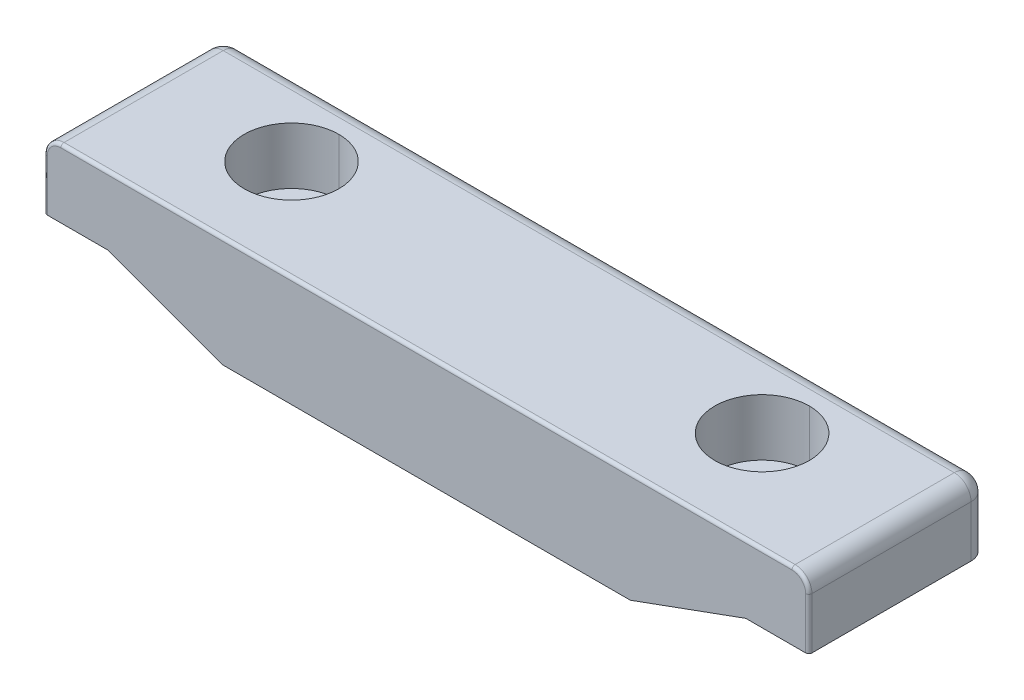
ISO-10303-21;
HEADER;
FILE_DESCRIPTION(('STEP AP214'),'2;1');
FILE_NAME('part.step','',(''),(''),'','','');
FILE_SCHEMA(('AUTOMOTIVE_DESIGN { 1 0 10303 214 1 1 1 1 }'));
ENDSEC;
DATA;
#1=APPLICATION_CONTEXT('core data for automotive mechanical design processes');
#2=APPLICATION_PROTOCOL_DEFINITION('international standard','automotive_design',2000,#1);
#3=PRODUCT_CONTEXT('',#1,'mechanical');
#4=PRODUCT('Part','Part','',(#3));
#5=PRODUCT_RELATED_PRODUCT_CATEGORY('part','',(#4));
#6=PRODUCT_DEFINITION_FORMATION('','',#4);
#7=PRODUCT_DEFINITION_CONTEXT('part definition',#1,'design');
#8=PRODUCT_DEFINITION('design','',#6,#7);
#9=PRODUCT_DEFINITION_SHAPE('','',#8);
#10=(LENGTH_UNIT() NAMED_UNIT(*) SI_UNIT(.MILLI.,.METRE.));
#11=(NAMED_UNIT(*) PLANE_ANGLE_UNIT() SI_UNIT($,.RADIAN.));
#12=(NAMED_UNIT(*) SI_UNIT($,.STERADIAN.) SOLID_ANGLE_UNIT());
#13=UNCERTAINTY_MEASURE_WITH_UNIT(LENGTH_MEASURE(1.E-05),#10,'distance_accuracy_value','');
#14=(GEOMETRIC_REPRESENTATION_CONTEXT(3) GLOBAL_UNCERTAINTY_ASSIGNED_CONTEXT((#13)) GLOBAL_UNIT_ASSIGNED_CONTEXT((#10,
#11,#12)) REPRESENTATION_CONTEXT('',''));
#15=CARTESIAN_POINT('',(0.,0.,0.));
#16=DIRECTION('',(0.,0.,1.));
#17=DIRECTION('',(1.,0.,0.));
#18=AXIS2_PLACEMENT_3D('',#15,#16,#17);
#19=CARTESIAN_POINT('',(5.22466570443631,47.8485746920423,12.5060604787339));
#20=DIRECTION('',(-0.342020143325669,0.939692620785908,0.));
#21=DIRECTION('',(0.,0.,1.));
#22=AXIS2_PLACEMENT_3D('',#19,#20,#21);
#23=PLANE('',#22);
#24=CARTESIAN_POINT('',(-2.77191409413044,44.9380576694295,5.70606047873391));
#25=CARTESIAN_POINT('',(-8.27191409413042,42.9362213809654,5.70606047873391));
#26=CARTESIAN_POINT('',(-8.27191409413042,42.9362213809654,0.20606047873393));
#27=CARTESIAN_POINT('',(-2.77191409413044,44.9380576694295,0.20606047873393));
#28=(BOUNDED_CURVE() B_SPLINE_CURVE(3,(#24,#25,#26,#27),.UNSPECIFIED.,.F.,
.F.) B_SPLINE_CURVE_WITH_KNOTS((4,4),(1.5707963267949,4.71238898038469),
.UNSPECIFIED.) CURVE() GEOMETRIC_REPRESENTATION_ITEM() RATIONAL_B_SPLINE_CURVE((1.,
0.333333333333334,0.333333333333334,1.)) REPRESENTATION_ITEM(''));
#29=CARTESIAN_POINT('',(-2.77191409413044,44.9380576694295,5.70606047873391));
#30=VERTEX_POINT('',#29);
#31=CARTESIAN_POINT('',(-2.77191409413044,44.9380576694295,0.20606047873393));
#32=VERTEX_POINT('',#31);
#33=EDGE_CURVE('E406',#30,#32,#28,.T.);
#34=ORIENTED_EDGE('',*,*,#33,.F.);
#35=CARTESIAN_POINT('',(-2.77191409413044,44.9380576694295,0.20606047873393));
#36=CARTESIAN_POINT('',(2.72808590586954,46.9398939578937,0.206060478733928));
#37=CARTESIAN_POINT('',(2.72808590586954,46.9398939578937,5.70606047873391));
#38=CARTESIAN_POINT('',(-2.77191409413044,44.9380576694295,5.70606047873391));
#39=(BOUNDED_CURVE() B_SPLINE_CURVE(3,(#35,#36,#37,#38),.UNSPECIFIED.,.F.,
.F.) B_SPLINE_CURVE_WITH_KNOTS((4,4),(4.71238898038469,7.85398163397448),
.UNSPECIFIED.) CURVE() GEOMETRIC_REPRESENTATION_ITEM() RATIONAL_B_SPLINE_CURVE((1.,
0.333333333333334,0.333333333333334,1.)) REPRESENTATION_ITEM(''));
#40=EDGE_CURVE('E332',#32,#30,#39,.T.);
#41=ORIENTED_EDGE('',*,*,#40,.F.);
#42=EDGE_LOOP('',(#34,#41));
#43=FACE_BOUND('',#42,.T.);
#44=DIRECTION('',(0.939692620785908,0.342020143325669,0.));
#45=VECTOR('',#44,1.);
#46=CARTESIAN_POINT('',(5.22466570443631,47.8485746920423,-4.54393952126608));
#47=LINE('',#46,#45);
#48=CARTESIAN_POINT('',(-5.76358704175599,43.8491777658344,-4.54393952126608));
#49=VERTEX_POINT('',#48);
#50=CARTESIAN_POINT('',(5.22632263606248,47.8491777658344,-4.54393952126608));
#51=VERTEX_POINT('',#50);
#52=EDGE_CURVE('E181',#49,#51,#47,.T.);
#53=ORIENTED_EDGE('',*,*,#52,.T.);
#54=DIRECTION('',(0.,0.,-1.));
#55=VECTOR('',#54,1.);
#56=CARTESIAN_POINT('',(5.22632263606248,47.8491777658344,12.5060604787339));
#57=LINE('',#56,#55);
#58=CARTESIAN_POINT('',(5.22632263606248,47.8491777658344,12.5060604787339));
#59=VERTEX_POINT('',#58);
#60=EDGE_CURVE('E158',#59,#51,#57,.T.);
#61=ORIENTED_EDGE('',*,*,#60,.F.);
#62=DIRECTION('',(0.939692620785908,0.342020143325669,0.));
#63=VECTOR('',#62,1.);
#64=CARTESIAN_POINT('',(5.22466570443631,47.8485746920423,12.5060604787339));
#65=LINE('',#64,#63);
#66=CARTESIAN_POINT('',(-5.76358704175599,43.8491777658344,12.5060604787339));
#67=VERTEX_POINT('',#66);
#68=EDGE_CURVE('E245',#67,#59,#65,.T.);
#69=ORIENTED_EDGE('',*,*,#68,.F.);
#70=DIRECTION('',(0.,0.,-1.));
#71=VECTOR('',#70,1.);
#72=CARTESIAN_POINT('',(-5.76358704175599,43.8491777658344,12.5060604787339));
#73=LINE('',#72,#71);
#74=EDGE_CURVE('E11',#67,#49,#73,.T.);
#75=ORIENTED_EDGE('',*,*,#74,.T.);
#76=EDGE_LOOP('',(#53,#61,#69,#75));
#77=FACE_BOUND('',#76,.T.);
#78=ADVANCED_FACE('F16',(#43,#77),#23,.F.);
#79=CARTESIAN_POINT('',(-5.76182377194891,43.8491777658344,12.5060604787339));
#80=DIRECTION('',(0.,1.,0.));
#81=DIRECTION('',(1.,0.,0.));
#82=AXIS2_PLACEMENT_3D('',#79,#80,#81);
#83=PLANE('',#82);
#84=DIRECTION('',(1.,0.,0.));
#85=VECTOR('',#84,1.);
#86=CARTESIAN_POINT('',(-5.76182377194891,43.8491777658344,-4.54393952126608));
#87=LINE('',#86,#85);
#88=CARTESIAN_POINT('',(-44.5802411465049,43.8491777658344,-4.54393952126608));
#89=VERTEX_POINT('',#88);
#90=EDGE_CURVE('E175',#89,#49,#87,.T.);
#91=ORIENTED_EDGE('',*,*,#90,.T.);
#92=ORIENTED_EDGE('',*,*,#74,.F.);
#93=DIRECTION('',(1.,0.,0.));
#94=VECTOR('',#93,1.);
#95=CARTESIAN_POINT('',(-5.76182377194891,43.8491777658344,12.5060604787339));
#96=LINE('',#95,#94);
#97=CARTESIAN_POINT('',(-44.5802411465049,43.8491777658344,12.5060604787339));
#98=VERTEX_POINT('',#97);
#99=EDGE_CURVE('E240',#98,#67,#96,.T.);
#100=ORIENTED_EDGE('',*,*,#99,.F.);
#101=DIRECTION('',(0.,0.,-1.));
#102=VECTOR('',#101,1.);
#103=CARTESIAN_POINT('',(-44.5802411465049,43.8491777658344,12.5060604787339));
#104=LINE('',#103,#102);
#105=EDGE_CURVE('E25',#98,#89,#104,.T.);
#106=ORIENTED_EDGE('',*,*,#105,.T.);
#107=EDGE_LOOP('',(#91,#92,#100,#106));
#108=FACE_BOUND('',#107,.T.);
#109=ADVANCED_FACE('F238',(#108),#83,.F.);
#110=CARTESIAN_POINT('',(-55.5684938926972,47.8485746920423,12.5060604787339));
#111=DIRECTION('',(0.342020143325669,0.939692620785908,0.));
#112=DIRECTION('',(0.,0.,-1.));
#113=AXIS2_PLACEMENT_3D('',#110,#111,#112);
#114=PLANE('',#113);
#115=CARTESIAN_POINT('',(-47.5719140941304,44.9380576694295,5.70606047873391));
#116=CARTESIAN_POINT('',(-53.0719140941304,46.9398939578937,5.70606047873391));
#117=CARTESIAN_POINT('',(-53.0719140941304,46.9398939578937,0.20606047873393));
#118=CARTESIAN_POINT('',(-47.5719140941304,44.9380576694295,0.20606047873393));
#119=(BOUNDED_CURVE() B_SPLINE_CURVE(3,(#115,#116,#117,#118),.UNSPECIFIED.,.F.,
.F.) B_SPLINE_CURVE_WITH_KNOTS((4,4),(4.71238898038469,7.85398163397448),
.UNSPECIFIED.) CURVE() GEOMETRIC_REPRESENTATION_ITEM() RATIONAL_B_SPLINE_CURVE((1.,
0.333333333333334,0.333333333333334,1.)) REPRESENTATION_ITEM(''));
#120=CARTESIAN_POINT('',(-47.5719140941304,44.9380576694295,5.70606047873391));
#121=VERTEX_POINT('',#120);
#122=CARTESIAN_POINT('',(-47.5719140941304,44.9380576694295,0.20606047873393));
#123=VERTEX_POINT('',#122);
#124=EDGE_CURVE('E437',#121,#123,#119,.T.);
#125=ORIENTED_EDGE('',*,*,#124,.F.);
#126=CARTESIAN_POINT('',(-47.5719140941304,44.9380576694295,0.20606047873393));
#127=CARTESIAN_POINT('',(-42.0719140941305,42.9362213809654,0.20606047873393));
#128=CARTESIAN_POINT('',(-42.0719140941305,42.9362213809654,5.70606047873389));
#129=CARTESIAN_POINT('',(-47.5719140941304,44.9380576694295,5.70606047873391));
#130=(BOUNDED_CURVE() B_SPLINE_CURVE(3,(#126,#127,#128,#129),.UNSPECIFIED.,.F.,
.F.) B_SPLINE_CURVE_WITH_KNOTS((4,4),(1.5707963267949,4.71238898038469),
.UNSPECIFIED.) CURVE() GEOMETRIC_REPRESENTATION_ITEM() RATIONAL_B_SPLINE_CURVE((1.,
0.333333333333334,0.333333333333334,1.)) REPRESENTATION_ITEM(''));
#131=EDGE_CURVE('E325',#123,#121,#130,.T.);
#132=ORIENTED_EDGE('',*,*,#131,.F.);
#133=EDGE_LOOP('',(#125,#132));
#134=FACE_BOUND('',#133,.T.);
#135=DIRECTION('',(0.939692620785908,-0.342020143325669,0.));
#136=VECTOR('',#135,1.);
#137=CARTESIAN_POINT('',(-55.5684938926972,47.8485746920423,-4.54393952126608));
#138=LINE('',#137,#136);
#139=CARTESIAN_POINT('',(-55.5701508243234,47.8491777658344,-4.54393952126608));
#140=VERTEX_POINT('',#139);
#141=EDGE_CURVE('E150',#140,#89,#138,.T.);
#142=ORIENTED_EDGE('',*,*,#141,.T.);
#143=ORIENTED_EDGE('',*,*,#105,.F.);
#144=DIRECTION('',(0.939692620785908,-0.342020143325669,0.));
#145=VECTOR('',#144,1.);
#146=CARTESIAN_POINT('',(-55.5684938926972,47.8485746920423,12.5060604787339));
#147=LINE('',#146,#145);
#148=CARTESIAN_POINT('',(-55.5701508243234,47.8491777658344,12.5060604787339));
#149=VERTEX_POINT('',#148);
#150=EDGE_CURVE('E153',#149,#98,#147,.T.);
#151=ORIENTED_EDGE('',*,*,#150,.F.);
#152=DIRECTION('',(0.,0.,-1.));
#153=VECTOR('',#152,1.);
#154=CARTESIAN_POINT('',(-55.5701508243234,47.8491777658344,12.5060604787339));
#155=LINE('',#154,#153);
#156=EDGE_CURVE('E146',#149,#140,#155,.T.);
#157=ORIENTED_EDGE('',*,*,#156,.T.);
#158=EDGE_LOOP('',(#142,#143,#151,#157));
#159=FACE_BOUND('',#158,.T.);
#160=ADVANCED_FACE('F148',(#134,#159),#114,.F.);
#161=CARTESIAN_POINT('',(-61.5719140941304,47.8491777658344,12.5060604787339));
#162=DIRECTION('',(0.,1.,0.));
#163=DIRECTION('',(1.,0.,0.));
#164=AXIS2_PLACEMENT_3D('',#161,#162,#163);
#165=PLANE('',#164);
#166=CARTESIAN_POINT('',(-59.9719140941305,47.8491777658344,-2.94393952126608));
#167=DIRECTION('',(0.,-1.,0.));
#168=DIRECTION('',(0.,0.,1.));
#169=AXIS2_PLACEMENT_3D('',#166,#167,#168);
#170=CIRCLE('',#169,1.6);
#171=CARTESIAN_POINT('',(-61.5719140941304,47.8491777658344,-2.94393952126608));
#172=VERTEX_POINT('',#171);
#173=CARTESIAN_POINT('',(-59.9719140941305,47.8491777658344,-4.54393952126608));
#174=VERTEX_POINT('',#173);
#175=EDGE_CURVE('E164',#172,#174,#170,.T.);
#176=ORIENTED_EDGE('',*,*,#175,.T.);
#177=DIRECTION('',(1.,0.,0.));
#178=VECTOR('',#177,1.);
#179=CARTESIAN_POINT('',(-61.5719140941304,47.8491777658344,-4.54393952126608));
#180=LINE('',#179,#178);
#181=EDGE_CURVE('E161',#174,#140,#180,.T.);
#182=ORIENTED_EDGE('',*,*,#181,.T.);
#183=ORIENTED_EDGE('',*,*,#156,.F.);
#184=DIRECTION('',(1.,0.,0.));
#185=VECTOR('',#184,1.);
#186=CARTESIAN_POINT('',(-61.5719140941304,47.8491777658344,12.5060604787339));
#187=LINE('',#186,#185);
#188=CARTESIAN_POINT('',(-61.2719140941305,47.8491777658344,12.5060604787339));
#189=VERTEX_POINT('',#188);
#190=EDGE_CURVE('E250',#189,#149,#187,.T.);
#191=ORIENTED_EDGE('',*,*,#190,.F.);
#192=CARTESIAN_POINT('',(-61.2719140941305,47.8491777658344,12.2060604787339));
#193=DIRECTION('',(0.,-1.,0.));
#194=DIRECTION('',(0.,0.,1.));
#195=AXIS2_PLACEMENT_3D('',#192,#193,#194);
#196=CIRCLE('',#195,0.3);
#197=CARTESIAN_POINT('',(-61.5719140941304,47.8491777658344,12.2060604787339));
#198=VERTEX_POINT('',#197);
#199=EDGE_CURVE('E211',#189,#198,#196,.T.);
#200=ORIENTED_EDGE('',*,*,#199,.T.);
#201=DIRECTION('',(0.,0.,-1.));
#202=VECTOR('',#201,1.);
#203=CARTESIAN_POINT('',(-61.5719140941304,47.8491777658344,12.5060604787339));
#204=LINE('',#203,#202);
#205=EDGE_CURVE('E301',#198,#172,#204,.T.);
#206=ORIENTED_EDGE('',*,*,#205,.T.);
#207=EDGE_LOOP('',(#176,#182,#183,#191,#200,#206));
#208=FACE_BOUND('',#207,.T.);
#209=ADVANCED_FACE('F162',(#208),#165,.F.);
#210=CARTESIAN_POINT('',(11.2280859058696,47.8491777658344,12.5060604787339));
#211=DIRECTION('',(0.,1.,0.));
#212=DIRECTION('',(1.,0.,0.));
#213=AXIS2_PLACEMENT_3D('',#210,#211,#212);
#214=PLANE('',#213);
#215=CARTESIAN_POINT('',(9.62808590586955,47.8491777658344,-2.94393952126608));
#216=DIRECTION('',(0.,-1.,0.));
#217=DIRECTION('',(0.,0.,1.));
#218=AXIS2_PLACEMENT_3D('',#215,#216,#217);
#219=CIRCLE('',#218,1.6);
#220=CARTESIAN_POINT('',(9.62808590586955,47.8491777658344,-4.54393952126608));
#221=VERTEX_POINT('',#220);
#222=CARTESIAN_POINT('',(11.2280859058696,47.8491777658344,-2.94393952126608));
#223=VERTEX_POINT('',#222);
#224=EDGE_CURVE('E189',#221,#223,#219,.T.);
#225=ORIENTED_EDGE('',*,*,#224,.T.);
#226=DIRECTION('',(0.,0.,-1.));
#227=VECTOR('',#226,1.);
#228=CARTESIAN_POINT('',(11.2280859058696,47.8491777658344,12.5060604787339));
#229=LINE('',#228,#227);
#230=CARTESIAN_POINT('',(11.2280859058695,47.8491777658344,12.2060604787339));
#231=VERTEX_POINT('',#230);
#232=EDGE_CURVE('E265',#231,#223,#229,.T.);
#233=ORIENTED_EDGE('',*,*,#232,.F.);
#234=CARTESIAN_POINT('',(10.9280859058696,47.8491777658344,12.2060604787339));
#235=DIRECTION('',(0.,-1.,0.));
#236=DIRECTION('',(0.,0.,1.));
#237=AXIS2_PLACEMENT_3D('',#234,#235,#236);
#238=CIRCLE('',#237,0.3);
#239=CARTESIAN_POINT('',(10.9280859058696,47.8491777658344,12.5060604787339));
#240=VERTEX_POINT('',#239);
#241=EDGE_CURVE('E224',#231,#240,#238,.T.);
#242=ORIENTED_EDGE('',*,*,#241,.T.);
#243=DIRECTION('',(1.,0.,0.));
#244=VECTOR('',#243,1.);
#245=CARTESIAN_POINT('',(11.2280859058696,47.8491777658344,12.5060604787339));
#246=LINE('',#245,#244);
#247=EDGE_CURVE('E345',#59,#240,#246,.T.);
#248=ORIENTED_EDGE('',*,*,#247,.F.);
#249=ORIENTED_EDGE('',*,*,#60,.T.);
#250=DIRECTION('',(1.,0.,0.));
#251=VECTOR('',#250,1.);
#252=CARTESIAN_POINT('',(11.2280859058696,47.8491777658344,-4.54393952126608));
#253=LINE('',#252,#251);
#254=EDGE_CURVE('E309',#51,#221,#253,.T.);
#255=ORIENTED_EDGE('',*,*,#254,.T.);
#256=EDGE_LOOP('',(#225,#233,#242,#248,#249,#255));
#257=FACE_BOUND('',#256,.T.);
#258=ADVANCED_FACE('F497',(#257),#214,.F.);
#259=CARTESIAN_POINT('',(-2.77191409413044,54.3391777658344,2.95606047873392));
#260=DIRECTION('',(0.,1.,0.));
#261=DIRECTION('',(0.,0.,1.));
#262=AXIS2_PLACEMENT_3D('',#259,#260,#261);
#263=CYLINDRICAL_SURFACE('',#262,4.5);
#264=DIRECTION('',(0.,1.,0.));
#265=VECTOR('',#264,1.);
#266=CARTESIAN_POINT('',(-2.77191409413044,54.3391777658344,-1.54393952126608));
#267=LINE('',#266,#265);
#268=CARTESIAN_POINT('',(-2.77191409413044,48.9391777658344,-1.54393952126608));
#269=VERTEX_POINT('',#268);
#270=CARTESIAN_POINT('',(-2.77191409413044,54.3391777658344,-1.54393952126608));
#271=VERTEX_POINT('',#270);
#272=EDGE_CURVE('E395',#269,#271,#267,.T.);
#273=ORIENTED_EDGE('',*,*,#272,.F.);
#274=CARTESIAN_POINT('',(-2.77191409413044,48.9391777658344,2.95606047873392));
#275=DIRECTION('',(0.,1.,0.));
#276=DIRECTION('',(0.,0.,1.));
#277=AXIS2_PLACEMENT_3D('',#274,#275,#276);
#278=CIRCLE('',#277,4.5);
#279=CARTESIAN_POINT('',(-2.77191409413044,48.9391777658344,7.45606047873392));
#280=VERTEX_POINT('',#279);
#281=EDGE_CURVE('E229',#280,#269,#278,.T.);
#282=ORIENTED_EDGE('',*,*,#281,.F.);
#283=DIRECTION('',(0.,1.,0.));
#284=VECTOR('',#283,1.);
#285=CARTESIAN_POINT('',(-2.77191409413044,54.3391777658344,7.45606047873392));
#286=LINE('',#285,#284);
#287=CARTESIAN_POINT('',(-2.77191409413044,54.3391777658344,7.45606047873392));
#288=VERTEX_POINT('',#287);
#289=EDGE_CURVE('E410',#280,#288,#286,.T.);
#290=ORIENTED_EDGE('',*,*,#289,.T.);
#291=CARTESIAN_POINT('',(-2.77191409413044,54.3391777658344,2.95606047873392));
#292=DIRECTION('',(0.,1.,0.));
#293=DIRECTION('',(0.,0.,1.));
#294=AXIS2_PLACEMENT_3D('',#291,#292,#293);
#295=CIRCLE('',#294,4.5);
#296=EDGE_CURVE('E290',#288,#271,#295,.T.);
#297=ORIENTED_EDGE('',*,*,#296,.T.);
#298=EDGE_LOOP('',(#273,#282,#290,#297));
#299=FACE_BOUND('',#298,.T.);
#300=ADVANCED_FACE('F624',(#299),#263,.F.);
#301=CARTESIAN_POINT('',(-0.0219140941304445,48.9391777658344,2.95606047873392));
#302=DIRECTION('',(0.,-1.,0.));
#303=DIRECTION('',(0.,0.,-1.));
#304=AXIS2_PLACEMENT_3D('',#301,#302,#303);
#305=PLANE('',#304);
#306=CARTESIAN_POINT('',(-2.77191409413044,48.9391777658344,2.95606047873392));
#307=DIRECTION('',(0.,1.,0.));
#308=DIRECTION('',(0.,0.,1.));
#309=AXIS2_PLACEMENT_3D('',#306,#307,#308);
#310=CIRCLE('',#309,2.75);
#311=CARTESIAN_POINT('',(-2.77191409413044,48.9391777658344,5.70606047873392));
#312=VERTEX_POINT('',#311);
#313=CARTESIAN_POINT('',(-2.77191409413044,48.9391777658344,0.206060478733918));
#314=VERTEX_POINT('',#313);
#315=EDGE_CURVE('E338',#312,#314,#310,.T.);
#316=ORIENTED_EDGE('',*,*,#315,.F.);
#317=CARTESIAN_POINT('',(-2.77191409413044,48.9391777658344,2.95606047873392));
#318=DIRECTION('',(0.,1.,0.));
#319=DIRECTION('',(0.,0.,1.));
#320=AXIS2_PLACEMENT_3D('',#317,#318,#319);
#321=CIRCLE('',#320,2.75);
#322=EDGE_CURVE('E405',#314,#312,#321,.T.);
#323=ORIENTED_EDGE('',*,*,#322,.F.);
#324=EDGE_LOOP('',(#316,#323));
#325=FACE_BOUND('',#324,.T.);
#326=ORIENTED_EDGE('',*,*,#281,.T.);
#327=CARTESIAN_POINT('',(-2.77191409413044,48.9391777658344,2.95606047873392));
#328=DIRECTION('',(0.,1.,0.));
#329=DIRECTION('',(0.,0.,1.));
#330=AXIS2_PLACEMENT_3D('',#327,#328,#329);
#331=CIRCLE('',#330,4.5);
#332=EDGE_CURVE('E393',#269,#280,#331,.T.);
#333=ORIENTED_EDGE('',*,*,#332,.T.);
#334=EDGE_LOOP('',(#326,#333));
#335=FACE_BOUND('',#334,.T.);
#336=ADVANCED_FACE('F618',(#325,#335),#305,.F.);
#337=CARTESIAN_POINT('',(-47.5719140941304,54.3391777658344,2.95606047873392));
#338=DIRECTION('',(0.,1.,0.));
#339=DIRECTION('',(0.,0.,1.));
#340=AXIS2_PLACEMENT_3D('',#337,#338,#339);
#341=CYLINDRICAL_SURFACE('',#340,4.5);
#342=DIRECTION('',(0.,1.,0.));
#343=VECTOR('',#342,1.);
#344=CARTESIAN_POINT('',(-47.5719140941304,54.3391777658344,-1.54393952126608));
#345=LINE('',#344,#343);
#346=CARTESIAN_POINT('',(-47.5719140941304,48.9391777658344,-1.54393952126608));
#347=VERTEX_POINT('',#346);
#348=CARTESIAN_POINT('',(-47.5719140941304,54.3391777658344,-1.54393952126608));
#349=VERTEX_POINT('',#348);
#350=EDGE_CURVE('E425',#347,#349,#345,.T.);
#351=ORIENTED_EDGE('',*,*,#350,.F.);
#352=CARTESIAN_POINT('',(-47.5719140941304,48.9391777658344,2.95606047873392));
#353=DIRECTION('',(0.,1.,0.));
#354=DIRECTION('',(0.,0.,1.));
#355=AXIS2_PLACEMENT_3D('',#352,#353,#354);
#356=CIRCLE('',#355,4.5);
#357=CARTESIAN_POINT('',(-47.5719140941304,48.9391777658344,7.45606047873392));
#358=VERTEX_POINT('',#357);
#359=EDGE_CURVE('E225',#358,#347,#356,.T.);
#360=ORIENTED_EDGE('',*,*,#359,.F.);
#361=DIRECTION('',(0.,1.,0.));
#362=VECTOR('',#361,1.);
#363=CARTESIAN_POINT('',(-47.5719140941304,54.3391777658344,7.45606047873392));
#364=LINE('',#363,#362);
#365=CARTESIAN_POINT('',(-47.5719140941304,54.3391777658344,7.45606047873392));
#366=VERTEX_POINT('',#365);
#367=EDGE_CURVE('E441',#358,#366,#364,.T.);
#368=ORIENTED_EDGE('',*,*,#367,.T.);
#369=CARTESIAN_POINT('',(-47.5719140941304,54.3391777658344,2.95606047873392));
#370=DIRECTION('',(0.,1.,0.));
#371=DIRECTION('',(0.,0.,1.));
#372=AXIS2_PLACEMENT_3D('',#369,#370,#371);
#373=CIRCLE('',#372,4.5);
#374=EDGE_CURVE('E296',#366,#349,#373,.T.);
#375=ORIENTED_EDGE('',*,*,#374,.T.);
#376=EDGE_LOOP('',(#351,#360,#368,#375));
#377=FACE_BOUND('',#376,.T.);
#378=ADVANCED_FACE('F602',(#377),#341,.F.);
#379=CARTESIAN_POINT('',(-44.8219140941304,48.9391777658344,2.95606047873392));
#380=DIRECTION('',(0.,-1.,0.));
#381=DIRECTION('',(0.,0.,-1.));
#382=AXIS2_PLACEMENT_3D('',#379,#380,#381);
#383=PLANE('',#382);
#384=CARTESIAN_POINT('',(-47.5719140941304,48.9391777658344,2.95606047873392));
#385=DIRECTION('',(0.,1.,0.));
#386=DIRECTION('',(0.,0.,1.));
#387=AXIS2_PLACEMENT_3D('',#384,#385,#386);
#388=CIRCLE('',#387,2.75);
#389=CARTESIAN_POINT('',(-47.5719140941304,48.9391777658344,5.70606047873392));
#390=VERTEX_POINT('',#389);
#391=CARTESIAN_POINT('',(-47.5719140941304,48.9391777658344,0.206060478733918));
#392=VERTEX_POINT('',#391);
#393=EDGE_CURVE('E329',#390,#392,#388,.T.);
#394=ORIENTED_EDGE('',*,*,#393,.F.);
#395=CARTESIAN_POINT('',(-47.5719140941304,48.9391777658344,2.95606047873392));
#396=DIRECTION('',(0.,1.,0.));
#397=DIRECTION('',(0.,0.,1.));
#398=AXIS2_PLACEMENT_3D('',#395,#396,#397);
#399=CIRCLE('',#398,2.75);
#400=EDGE_CURVE('E436',#392,#390,#399,.T.);
#401=ORIENTED_EDGE('',*,*,#400,.F.);
#402=EDGE_LOOP('',(#394,#401));
#403=FACE_BOUND('',#402,.T.);
#404=ORIENTED_EDGE('',*,*,#359,.T.);
#405=CARTESIAN_POINT('',(-47.5719140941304,48.9391777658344,2.95606047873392));
#406=DIRECTION('',(0.,1.,0.));
#407=DIRECTION('',(0.,0.,1.));
#408=AXIS2_PLACEMENT_3D('',#405,#406,#407);
#409=CIRCLE('',#408,4.5);
#410=EDGE_CURVE('E421',#347,#358,#409,.T.);
#411=ORIENTED_EDGE('',*,*,#410,.T.);
#412=EDGE_LOOP('',(#404,#411));
#413=FACE_BOUND('',#412,.T.);
#414=ADVANCED_FACE('F610',(#403,#413),#383,.F.);
#415=CARTESIAN_POINT('',(10.9280859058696,25.3391777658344,12.2060604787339));
#416=DIRECTION('',(0.,-1.,0.));
#417=DIRECTION('',(1.,0.,0.));
#418=AXIS2_PLACEMENT_3D('',#415,#416,#417);
#419=CYLINDRICAL_SURFACE('',#418,0.3);
#420=ORIENTED_EDGE('',*,*,#241,.F.);
#421=DIRECTION('',(0.,-1.,0.));
#422=VECTOR('',#421,1.);
#423=CARTESIAN_POINT('',(11.2280859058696,-3.66082223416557,12.2060604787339));
#424=LINE('',#423,#422);
#425=CARTESIAN_POINT('',(11.2280859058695,52.7391777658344,12.2060604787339));
#426=VERTEX_POINT('',#425);
#427=EDGE_CURVE('E261',#426,#231,#424,.T.);
#428=ORIENTED_EDGE('',*,*,#427,.F.);
#429=CARTESIAN_POINT('',(10.9280859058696,52.7391777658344,12.2060604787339));
#430=DIRECTION('',(0.,-1.,0.));
#431=DIRECTION('',(0.,0.,-1.));
#432=AXIS2_PLACEMENT_3D('',#429,#430,#431);
#433=CIRCLE('',#432,0.3);
#434=CARTESIAN_POINT('',(10.9280859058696,52.7391777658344,12.5060604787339));
#435=VERTEX_POINT('',#434);
#436=EDGE_CURVE('E221',#426,#435,#433,.T.);
#437=ORIENTED_EDGE('',*,*,#436,.T.);
#438=DIRECTION('',(0.,1.,0.));
#439=VECTOR('',#438,1.);
#440=CARTESIAN_POINT('',(10.9280859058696,52.7391777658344,12.5060604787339));
#441=LINE('',#440,#439);
#442=EDGE_CURVE('E348',#240,#435,#441,.T.);
#443=ORIENTED_EDGE('',*,*,#442,.F.);
#444=EDGE_LOOP('',(#420,#428,#437,#443));
#445=FACE_BOUND('',#444,.T.);
#446=ADVANCED_FACE('F513',(#445),#419,.T.);
#447=CARTESIAN_POINT('',(9.62808590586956,52.7391777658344,12.2060604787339));
#448=DIRECTION('',(0.,0.,1.));
#449=DIRECTION('',(1.,0.,0.));
#450=AXIS2_PLACEMENT_3D('',#447,#448,#449);
#451=TOROIDAL_SURFACE('',#450,1.3,0.3);
#452=CARTESIAN_POINT('',(9.62808590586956,54.0391777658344,12.2060604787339));
#453=DIRECTION('',(1.,0.,0.));
#454=DIRECTION('',(0.,0.,-1.));
#455=AXIS2_PLACEMENT_3D('',#452,#453,#454);
#456=CIRCLE('',#455,0.3);
#457=CARTESIAN_POINT('',(9.62808590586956,54.3391777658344,12.2060604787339));
#458=VERTEX_POINT('',#457);
#459=CARTESIAN_POINT('',(9.62808590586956,54.0391777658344,12.5060604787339));
#460=VERTEX_POINT('',#459);
#461=EDGE_CURVE('E218',#458,#460,#456,.T.);
#462=ORIENTED_EDGE('',*,*,#461,.T.);
#463=CARTESIAN_POINT('',(9.62808590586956,52.7391777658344,12.5060604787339));
#464=DIRECTION('',(0.,0.,1.));
#465=DIRECTION('',(1.,0.,0.));
#466=AXIS2_PLACEMENT_3D('',#463,#464,#465);
#467=CIRCLE('',#466,1.3);
#468=EDGE_CURVE('E354',#435,#460,#467,.T.);
#469=ORIENTED_EDGE('',*,*,#468,.F.);
#470=ORIENTED_EDGE('',*,*,#436,.F.);
#471=CARTESIAN_POINT('',(9.62808590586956,52.7391777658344,12.2060604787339));
#472=DIRECTION('',(0.,0.,-1.));
#473=DIRECTION('',(1.,0.,0.));
#474=AXIS2_PLACEMENT_3D('',#471,#472,#473);
#475=CIRCLE('',#474,1.6);
#476=EDGE_CURVE('E193',#458,#426,#475,.T.);
#477=ORIENTED_EDGE('',*,*,#476,.F.);
#478=EDGE_LOOP('',(#462,#469,#470,#477));
#479=FACE_BOUND('',#478,.T.);
#480=ADVANCED_FACE('F517',(#479),#451,.T.);
#481=CARTESIAN_POINT('',(-25.1719140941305,54.0391777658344,12.2060604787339));
#482=DIRECTION('',(1.,0.,0.));
#483=DIRECTION('',(0.,0.,-1.));
#484=AXIS2_PLACEMENT_3D('',#481,#482,#483);
#485=CYLINDRICAL_SURFACE('',#484,0.3);
#486=CARTESIAN_POINT('',(-59.9719140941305,54.0391777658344,12.2060604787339));
#487=DIRECTION('',(1.,0.,0.));
#488=DIRECTION('',(0.,0.,-1.));
#489=AXIS2_PLACEMENT_3D('',#486,#487,#488);
#490=CIRCLE('',#489,0.3);
#491=CARTESIAN_POINT('',(-59.9719140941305,54.3391777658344,12.2060604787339));
#492=VERTEX_POINT('',#491);
#493=CARTESIAN_POINT('',(-59.9719140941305,54.0391777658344,12.5060604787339));
#494=VERTEX_POINT('',#493);
#495=EDGE_CURVE('E217',#492,#494,#490,.T.);
#496=ORIENTED_EDGE('',*,*,#495,.T.);
#497=DIRECTION('',(-1.,0.,0.));
#498=VECTOR('',#497,1.);
#499=CARTESIAN_POINT('',(-59.9719140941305,54.0391777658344,12.5060604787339));
#500=LINE('',#499,#498);
#501=EDGE_CURVE('E358',#460,#494,#500,.T.);
#502=ORIENTED_EDGE('',*,*,#501,.F.);
#503=ORIENTED_EDGE('',*,*,#461,.F.);
#504=DIRECTION('',(1.,0.,0.));
#505=VECTOR('',#504,1.);
#506=CARTESIAN_POINT('',(9.62808590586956,54.3391777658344,12.2060604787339));
#507=LINE('',#506,#505);
#508=EDGE_CURVE('E278',#492,#458,#507,.T.);
#509=ORIENTED_EDGE('',*,*,#508,.F.);
#510=EDGE_LOOP('',(#496,#502,#503,#509));
#511=FACE_BOUND('',#510,.T.);
#512=ADVANCED_FACE('F522',(#511),#485,.T.);
#513=CARTESIAN_POINT('',(-59.9719140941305,52.7391777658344,12.2060604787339));
#514=DIRECTION('',(0.,0.,1.));
#515=DIRECTION('',(1.,0.,0.));
#516=AXIS2_PLACEMENT_3D('',#513,#514,#515);
#517=TOROIDAL_SURFACE('',#516,1.3,0.3);
#518=CARTESIAN_POINT('',(-61.2719140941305,52.7391777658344,12.2060604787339));
#519=DIRECTION('',(0.,1.,0.));
#520=DIRECTION('',(0.,0.,1.));
#521=AXIS2_PLACEMENT_3D('',#518,#519,#520);
#522=CIRCLE('',#521,0.3);
#523=CARTESIAN_POINT('',(-61.5719140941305,52.7391777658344,12.2060604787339));
#524=VERTEX_POINT('',#523);
#525=CARTESIAN_POINT('',(-61.2719140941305,52.7391777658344,12.5060604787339));
#526=VERTEX_POINT('',#525);
#527=EDGE_CURVE('E214',#524,#526,#522,.T.);
#528=ORIENTED_EDGE('',*,*,#527,.T.);
#529=CARTESIAN_POINT('',(-59.9719140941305,52.7391777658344,12.5060604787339));
#530=DIRECTION('',(0.,0.,1.));
#531=DIRECTION('',(1.,0.,0.));
#532=AXIS2_PLACEMENT_3D('',#529,#530,#531);
#533=CIRCLE('',#532,1.3);
#534=EDGE_CURVE('E365',#494,#526,#533,.T.);
#535=ORIENTED_EDGE('',*,*,#534,.F.);
#536=ORIENTED_EDGE('',*,*,#495,.F.);
#537=CARTESIAN_POINT('',(-59.9719140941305,52.7391777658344,12.2060604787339));
#538=DIRECTION('',(0.,0.,-1.));
#539=DIRECTION('',(1.,0.,0.));
#540=AXIS2_PLACEMENT_3D('',#537,#538,#539);
#541=CIRCLE('',#540,1.6);
#542=EDGE_CURVE('E207',#524,#492,#541,.T.);
#543=ORIENTED_EDGE('',*,*,#542,.F.);
#544=EDGE_LOOP('',(#528,#535,#536,#543));
#545=FACE_BOUND('',#544,.T.);
#546=ADVANCED_FACE('F526',(#545),#517,.T.);
#547=CARTESIAN_POINT('',(-61.2719140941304,25.3391777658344,12.2060604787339));
#548=DIRECTION('',(0.,1.,0.));
#549=DIRECTION('',(-1.,0.,0.));
#550=AXIS2_PLACEMENT_3D('',#547,#548,#549);
#551=CYLINDRICAL_SURFACE('',#550,0.3);
#552=ORIENTED_EDGE('',*,*,#199,.F.);
#553=DIRECTION('',(0.,-1.,0.));
#554=VECTOR('',#553,1.);
#555=CARTESIAN_POINT('',(-61.2719140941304,-3.66082223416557,12.5060604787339));
#556=LINE('',#555,#554);
#557=EDGE_CURVE('E255',#526,#189,#556,.T.);
#558=ORIENTED_EDGE('',*,*,#557,.F.);
#559=ORIENTED_EDGE('',*,*,#527,.F.);
#560=DIRECTION('',(0.,1.,0.));
#561=VECTOR('',#560,1.);
#562=CARTESIAN_POINT('',(-61.5719140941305,52.7391777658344,12.2060604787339));
#563=LINE('',#562,#561);
#564=EDGE_CURVE('E304',#198,#524,#563,.T.);
#565=ORIENTED_EDGE('',*,*,#564,.F.);
#566=EDGE_LOOP('',(#552,#558,#559,#565));
#567=FACE_BOUND('',#566,.T.);
#568=ADVANCED_FACE('F375',(#567),#551,.T.);
#569=CARTESIAN_POINT('',(-59.9719140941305,52.7391777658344,12.5060604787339));
#570=DIRECTION('',(0.,0.,-1.));
#571=DIRECTION('',(-1.,0.,0.));
#572=AXIS2_PLACEMENT_3D('',#569,#570,#571);
#573=CYLINDRICAL_SURFACE('',#572,1.6);
#574=DIRECTION('',(0.,0.,-1.));
#575=VECTOR('',#574,1.);
#576=CARTESIAN_POINT('',(-61.5719140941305,52.7391777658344,12.5060604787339));
#577=LINE('',#576,#575);
#578=CARTESIAN_POINT('',(-61.5719140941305,52.7391777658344,-2.94393952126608));
#579=VERTEX_POINT('',#578);
#580=EDGE_CURVE('E305',#524,#579,#577,.T.);
#581=ORIENTED_EDGE('',*,*,#580,.F.);
#582=ORIENTED_EDGE('',*,*,#542,.T.);
#583=DIRECTION('',(0.,0.,1.));
#584=VECTOR('',#583,1.);
#585=CARTESIAN_POINT('',(-59.9719140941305,54.3391777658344,12.5060604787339));
#586=LINE('',#585,#584);
#587=CARTESIAN_POINT('',(-59.9719140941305,54.3391777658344,-2.94393952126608));
#588=VERTEX_POINT('',#587);
#589=EDGE_CURVE('E274',#588,#492,#586,.T.);
#590=ORIENTED_EDGE('',*,*,#589,.F.);
#591=CARTESIAN_POINT('',(-59.9719140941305,52.7391777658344,-2.94393952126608));
#592=DIRECTION('',(0.,0.,1.));
#593=DIRECTION('',(-1.,0.,0.));
#594=AXIS2_PLACEMENT_3D('',#591,#592,#593);
#595=CIRCLE('',#594,1.6);
#596=EDGE_CURVE('E206',#588,#579,#595,.T.);
#597=ORIENTED_EDGE('',*,*,#596,.T.);
#598=EDGE_LOOP('',(#581,#582,#590,#597));
#599=FACE_BOUND('',#598,.T.);
#600=ADVANCED_FACE('F529',(#599),#573,.T.);
#601=CARTESIAN_POINT('',(-59.9719140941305,52.7391777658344,-2.94393952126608));
#602=DIRECTION('',(0.,1.,0.));
#603=DIRECTION('',(1.,0.,0.));
#604=AXIS2_PLACEMENT_3D('',#601,#602,#603);
#605=SPHERICAL_SURFACE('',#604,1.6);
#606=CARTESIAN_POINT('',(-59.9719140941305,52.7391777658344,-2.94393952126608));
#607=DIRECTION('',(-1.,0.,0.));
#608=DIRECTION('',(0.,0.,1.));
#609=AXIS2_PLACEMENT_3D('',#606,#607,#608);
#610=CIRCLE('',#609,1.6);
#611=CARTESIAN_POINT('',(-59.9719140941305,52.7391777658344,-4.54393952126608));
#612=VERTEX_POINT('',#611);
#613=EDGE_CURVE('E37',#588,#612,#610,.T.);
#614=ORIENTED_EDGE('',*,*,#613,.T.);
#615=CARTESIAN_POINT('',(-59.9719140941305,52.7391777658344,-2.94393952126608));
#616=DIRECTION('',(0.,1.,0.));
#617=DIRECTION('',(0.,0.,1.));
#618=AXIS2_PLACEMENT_3D('',#615,#616,#617);
#619=CIRCLE('',#618,1.6);
#620=EDGE_CURVE('E203',#612,#579,#619,.T.);
#621=ORIENTED_EDGE('',*,*,#620,.T.);
#622=ORIENTED_EDGE('',*,*,#596,.F.);
#623=EDGE_LOOP('',(#614,#621,#622));
#624=FACE_BOUND('',#623,.T.);
#625=ADVANCED_FACE('F530',(#624),#605,.T.);
#626=CARTESIAN_POINT('',(-61.5719140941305,52.7391777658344,-2.94393952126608));
#627=DIRECTION('',(-1.,0.,0.));
#628=DIRECTION('',(0.,0.,1.));
#629=AXIS2_PLACEMENT_3D('',#626,#627,#628);
#630=CYLINDRICAL_SURFACE('',#629,1.6);
#631=CARTESIAN_POINT('',(9.62808590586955,52.7391777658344,-2.94393952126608));
#632=DIRECTION('',(-1.,0.,0.));
#633=DIRECTION('',(0.,1.,0.));
#634=AXIS2_PLACEMENT_3D('',#631,#632,#633);
#635=CIRCLE('',#634,1.6);
#636=CARTESIAN_POINT('',(9.62808590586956,54.3391777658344,-2.94393952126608));
#637=VERTEX_POINT('',#636);
#638=CARTESIAN_POINT('',(9.62808590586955,52.7391777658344,-4.54393952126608));
#639=VERTEX_POINT('',#638);
#640=EDGE_CURVE('E198',#637,#639,#635,.T.);
#641=ORIENTED_EDGE('',*,*,#640,.T.);
#642=DIRECTION('',(1.,0.,0.));
#643=VECTOR('',#642,1.);
#644=CARTESIAN_POINT('',(-25.1719140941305,52.7391777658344,-4.54393952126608));
#645=LINE('',#644,#643);
#646=EDGE_CURVE('E188',#612,#639,#645,.T.);
#647=ORIENTED_EDGE('',*,*,#646,.F.);
#648=ORIENTED_EDGE('',*,*,#613,.F.);
#649=DIRECTION('',(-1.,0.,0.));
#650=VECTOR('',#649,1.);
#651=CARTESIAN_POINT('',(-61.5719140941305,54.3391777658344,-2.94393952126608));
#652=LINE('',#651,#650);
#653=EDGE_CURVE('E286',#637,#588,#652,.T.);
#654=ORIENTED_EDGE('',*,*,#653,.F.);
#655=EDGE_LOOP('',(#641,#647,#648,#654));
#656=FACE_BOUND('',#655,.T.);
#657=ADVANCED_FACE('F534',(#656),#630,.T.);
#658=CARTESIAN_POINT('',(-59.9719140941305,54.3391777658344,-2.94393952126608));
#659=DIRECTION('',(0.,-1.,0.));
#660=DIRECTION('',(1.,0.,0.));
#661=AXIS2_PLACEMENT_3D('',#658,#659,#660);
#662=CYLINDRICAL_SURFACE('',#661,1.6);
#663=ORIENTED_EDGE('',*,*,#175,.F.);
#664=DIRECTION('',(0.,-1.,0.));
#665=VECTOR('',#664,1.);
#666=CARTESIAN_POINT('',(-61.5719140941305,54.3391777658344,-2.94393952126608));
#667=LINE('',#666,#665);
#668=EDGE_CURVE('E300',#579,#172,#667,.T.);
#669=ORIENTED_EDGE('',*,*,#668,.F.);
#670=ORIENTED_EDGE('',*,*,#620,.F.);
#671=DIRECTION('',(0.,1.,0.));
#672=VECTOR('',#671,1.);
#673=CARTESIAN_POINT('',(-59.9719140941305,25.3391777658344,-4.54393952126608));
#674=LINE('',#673,#672);
#675=EDGE_CURVE('E169',#174,#612,#674,.T.);
#676=ORIENTED_EDGE('',*,*,#675,.F.);
#677=EDGE_LOOP('',(#663,#669,#670,#676));
#678=FACE_BOUND('',#677,.T.);
#679=ADVANCED_FACE('F532',(#678),#662,.T.);
#680=CARTESIAN_POINT('',(9.62808590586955,52.7391777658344,-2.94393952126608));
#681=DIRECTION('',(0.,1.,0.));
#682=DIRECTION('',(1.,0.,0.));
#683=AXIS2_PLACEMENT_3D('',#680,#681,#682);
#684=SPHERICAL_SURFACE('',#683,1.6);
#685=CARTESIAN_POINT('',(9.62808590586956,52.7391777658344,-2.94393952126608));
#686=DIRECTION('',(0.,0.,-1.));
#687=DIRECTION('',(-1.,0.,0.));
#688=AXIS2_PLACEMENT_3D('',#685,#686,#687);
#689=CIRCLE('',#688,1.6);
#690=CARTESIAN_POINT('',(11.2280859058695,52.7391777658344,-2.94393952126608));
#691=VERTEX_POINT('',#690);
#692=EDGE_CURVE('E197',#637,#691,#689,.T.);
#693=ORIENTED_EDGE('',*,*,#692,.T.);
#694=CARTESIAN_POINT('',(9.62808590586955,52.7391777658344,-2.94393952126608));
#695=DIRECTION('',(0.,1.,0.));
#696=DIRECTION('',(0.,0.,1.));
#697=AXIS2_PLACEMENT_3D('',#694,#695,#696);
#698=CIRCLE('',#697,1.6);
#699=EDGE_CURVE('E192',#691,#639,#698,.T.);
#700=ORIENTED_EDGE('',*,*,#699,.T.);
#701=ORIENTED_EDGE('',*,*,#640,.F.);
#702=EDGE_LOOP('',(#693,#700,#701));
#703=FACE_BOUND('',#702,.T.);
#704=ADVANCED_FACE('F735',(#703),#684,.T.);
#705=CARTESIAN_POINT('',(9.62808590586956,52.7391777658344,12.5060604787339));
#706=DIRECTION('',(0.,0.,-1.));
#707=DIRECTION('',(-1.,0.,0.));
#708=AXIS2_PLACEMENT_3D('',#705,#706,#707);
#709=CYLINDRICAL_SURFACE('',#708,1.6);
#710=DIRECTION('',(0.,0.,-1.));
#711=VECTOR('',#710,1.);
#712=CARTESIAN_POINT('',(9.62808590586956,54.3391777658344,12.5060604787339));
#713=LINE('',#712,#711);
#714=EDGE_CURVE('E282',#458,#637,#713,.T.);
#715=ORIENTED_EDGE('',*,*,#714,.F.);
#716=ORIENTED_EDGE('',*,*,#476,.T.);
#717=DIRECTION('',(0.,0.,1.));
#718=VECTOR('',#717,1.);
#719=CARTESIAN_POINT('',(11.2280859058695,52.7391777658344,12.5060604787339));
#720=LINE('',#719,#718);
#721=EDGE_CURVE('E270',#691,#426,#720,.T.);
#722=ORIENTED_EDGE('',*,*,#721,.F.);
#723=ORIENTED_EDGE('',*,*,#692,.F.);
#724=EDGE_LOOP('',(#715,#716,#722,#723));
#725=FACE_BOUND('',#724,.T.);
#726=ADVANCED_FACE('F745',(#725),#709,.T.);
#727=CARTESIAN_POINT('',(9.62808590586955,54.3391777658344,-2.94393952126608));
#728=DIRECTION('',(0.,1.,0.));
#729=DIRECTION('',(-1.,0.,0.));
#730=AXIS2_PLACEMENT_3D('',#727,#728,#729);
#731=CYLINDRICAL_SURFACE('',#730,1.6);
#732=ORIENTED_EDGE('',*,*,#224,.F.);
#733=DIRECTION('',(0.,-1.,0.));
#734=VECTOR('',#733,1.);
#735=CARTESIAN_POINT('',(9.62808590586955,25.3391777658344,-4.54393952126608));
#736=LINE('',#735,#734);
#737=EDGE_CURVE('E308',#639,#221,#736,.T.);
#738=ORIENTED_EDGE('',*,*,#737,.F.);
#739=ORIENTED_EDGE('',*,*,#699,.F.);
#740=DIRECTION('',(0.,1.,0.));
#741=VECTOR('',#740,1.);
#742=CARTESIAN_POINT('',(11.2280859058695,54.3391777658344,-2.94393952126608));
#743=LINE('',#742,#741);
#744=EDGE_CURVE('E269',#223,#691,#743,.T.);
#745=ORIENTED_EDGE('',*,*,#744,.F.);
#746=EDGE_LOOP('',(#732,#738,#739,#745));
#747=FACE_BOUND('',#746,.T.);
#748=ADVANCED_FACE('F539',(#747),#731,.T.);
#749=CARTESIAN_POINT('',(-25.1719140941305,25.3391777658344,-4.54393952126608));
#750=DIRECTION('',(0.,0.,1.));
#751=DIRECTION('',(1.,0.,0.));
#752=AXIS2_PLACEMENT_3D('',#749,#750,#751);
#753=PLANE('',#752);
#754=ORIENTED_EDGE('',*,*,#737,.T.);
#755=ORIENTED_EDGE('',*,*,#254,.F.);
#756=ORIENTED_EDGE('',*,*,#52,.F.);
#757=ORIENTED_EDGE('',*,*,#90,.F.);
#758=ORIENTED_EDGE('',*,*,#141,.F.);
#759=ORIENTED_EDGE('',*,*,#181,.F.);
#760=ORIENTED_EDGE('',*,*,#675,.T.);
#761=ORIENTED_EDGE('',*,*,#646,.T.);
#762=EDGE_LOOP('',(#754,#755,#756,#757,#758,#759,#760,#761));
#763=FACE_BOUND('',#762,.T.);
#764=ADVANCED_FACE('F172',(#763),#753,.F.);
#765=CARTESIAN_POINT('',(-61.5719140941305,54.3391777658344,12.5060604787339));
#766=DIRECTION('',(1.,0.,0.));
#767=DIRECTION('',(0.,1.,0.));
#768=AXIS2_PLACEMENT_3D('',#765,#766,#767);
#769=PLANE('',#768);
#770=ORIENTED_EDGE('',*,*,#668,.T.);
#771=ORIENTED_EDGE('',*,*,#205,.F.);
#772=ORIENTED_EDGE('',*,*,#564,.T.);
#773=ORIENTED_EDGE('',*,*,#580,.T.);
#774=EDGE_LOOP('',(#770,#771,#772,#773));
#775=FACE_BOUND('',#774,.T.);
#776=ADVANCED_FACE('F383',(#775),#769,.F.);
#777=CARTESIAN_POINT('',(-61.5719140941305,54.3391777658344,12.5060604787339));
#778=DIRECTION('',(0.,-1.,0.));
#779=DIRECTION('',(0.,0.,-1.));
#780=AXIS2_PLACEMENT_3D('',#777,#778,#779);
#781=PLANE('',#780);
#782=ORIENTED_EDGE('',*,*,#374,.F.);
#783=CARTESIAN_POINT('',(-47.5719140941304,54.3391777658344,2.95606047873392));
#784=DIRECTION('',(0.,1.,0.));
#785=DIRECTION('',(0.,0.,1.));
#786=AXIS2_PLACEMENT_3D('',#783,#784,#785);
#787=CIRCLE('',#786,4.5);
#788=EDGE_CURVE('E431',#349,#366,#787,.T.);
#789=ORIENTED_EDGE('',*,*,#788,.F.);
#790=EDGE_LOOP('',(#782,#789));
#791=FACE_BOUND('',#790,.T.);
#792=ORIENTED_EDGE('',*,*,#296,.F.);
#793=CARTESIAN_POINT('',(-2.77191409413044,54.3391777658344,2.95606047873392));
#794=DIRECTION('',(0.,1.,0.));
#795=DIRECTION('',(0.,0.,1.));
#796=AXIS2_PLACEMENT_3D('',#793,#794,#795);
#797=CIRCLE('',#796,4.5);
#798=EDGE_CURVE('E398',#271,#288,#797,.T.);
#799=ORIENTED_EDGE('',*,*,#798,.F.);
#800=EDGE_LOOP('',(#792,#799));
#801=FACE_BOUND('',#800,.T.);
#802=ORIENTED_EDGE('',*,*,#589,.T.);
#803=ORIENTED_EDGE('',*,*,#508,.T.);
#804=ORIENTED_EDGE('',*,*,#714,.T.);
#805=ORIENTED_EDGE('',*,*,#653,.T.);
#806=EDGE_LOOP('',(#802,#803,#804,#805));
#807=FACE_BOUND('',#806,.T.);
#808=ADVANCED_FACE('F605',(#791,#801,#807),#781,.F.);
#809=CARTESIAN_POINT('',(11.2280859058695,54.3391777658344,12.5060604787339));
#810=DIRECTION('',(-1.,0.,0.));
#811=DIRECTION('',(0.,1.,0.));
#812=AXIS2_PLACEMENT_3D('',#809,#810,#811);
#813=PLANE('',#812);
#814=ORIENTED_EDGE('',*,*,#427,.T.);
#815=ORIENTED_EDGE('',*,*,#232,.T.);
#816=ORIENTED_EDGE('',*,*,#744,.T.);
#817=ORIENTED_EDGE('',*,*,#721,.T.);
#818=EDGE_LOOP('',(#814,#815,#816,#817));
#819=FACE_BOUND('',#818,.T.);
#820=ADVANCED_FACE('F793',(#819),#813,.F.);
#821=CARTESIAN_POINT('',(-25.1719140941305,25.3391777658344,12.5060604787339));
#822=DIRECTION('',(0.,0.,1.));
#823=DIRECTION('',(1.,0.,0.));
#824=AXIS2_PLACEMENT_3D('',#821,#822,#823);
#825=PLANE('',#824);
#826=ORIENTED_EDGE('',*,*,#247,.T.);
#827=ORIENTED_EDGE('',*,*,#442,.T.);
#828=ORIENTED_EDGE('',*,*,#468,.T.);
#829=ORIENTED_EDGE('',*,*,#501,.T.);
#830=ORIENTED_EDGE('',*,*,#534,.T.);
#831=ORIENTED_EDGE('',*,*,#557,.T.);
#832=ORIENTED_EDGE('',*,*,#190,.T.);
#833=ORIENTED_EDGE('',*,*,#150,.T.);
#834=ORIENTED_EDGE('',*,*,#99,.T.);
#835=ORIENTED_EDGE('',*,*,#68,.T.);
#836=EDGE_LOOP('',(#826,#827,#828,#829,#830,#831,#832,#833,#834,#835));
#837=FACE_BOUND('',#836,.T.);
#838=ADVANCED_FACE('F248',(#837),#825,.T.);
#839=CARTESIAN_POINT('',(-2.77191409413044,54.3391777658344,2.95606047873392));
#840=DIRECTION('',(0.,1.,0.));
#841=DIRECTION('',(0.,0.,1.));
#842=AXIS2_PLACEMENT_3D('',#839,#840,#841);
#843=CYLINDRICAL_SURFACE('',#842,2.75);
#844=DIRECTION('',(0.,1.,0.));
#845=VECTOR('',#844,1.);
#846=CARTESIAN_POINT('',(-2.77191409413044,54.3391777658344,0.20606047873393));
#847=LINE('',#846,#845);
#848=EDGE_CURVE('E401',#32,#314,#847,.T.);
#849=ORIENTED_EDGE('',*,*,#848,.F.);
#850=ORIENTED_EDGE('',*,*,#40,.T.);
#851=DIRECTION('',(0.,1.,0.));
#852=VECTOR('',#851,1.);
#853=CARTESIAN_POINT('',(-2.77191409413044,54.3391777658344,5.70606047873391));
#854=LINE('',#853,#852);
#855=EDGE_CURVE('E417',#30,#312,#854,.T.);
#856=ORIENTED_EDGE('',*,*,#855,.T.);
#857=ORIENTED_EDGE('',*,*,#315,.T.);
#858=EDGE_LOOP('',(#849,#850,#856,#857));
#859=FACE_BOUND('',#858,.T.);
#860=ADVANCED_FACE('F813',(#859),#843,.F.);
#861=CARTESIAN_POINT('',(-47.5719140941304,54.3391777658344,2.95606047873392));
#862=DIRECTION('',(0.,1.,0.));
#863=DIRECTION('',(0.,0.,1.));
#864=AXIS2_PLACEMENT_3D('',#861,#862,#863);
#865=CYLINDRICAL_SURFACE('',#864,2.75);
#866=DIRECTION('',(0.,1.,0.));
#867=VECTOR('',#866,1.);
#868=CARTESIAN_POINT('',(-47.5719140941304,54.3391777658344,0.20606047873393));
#869=LINE('',#868,#867);
#870=EDGE_CURVE('E432',#123,#392,#869,.T.);
#871=ORIENTED_EDGE('',*,*,#870,.F.);
#872=ORIENTED_EDGE('',*,*,#131,.T.);
#873=DIRECTION('',(0.,1.,0.));
#874=VECTOR('',#873,1.);
#875=CARTESIAN_POINT('',(-47.5719140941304,54.3391777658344,5.70606047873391));
#876=LINE('',#875,#874);
#877=EDGE_CURVE('E445',#121,#390,#876,.T.);
#878=ORIENTED_EDGE('',*,*,#877,.T.);
#879=ORIENTED_EDGE('',*,*,#393,.T.);
#880=EDGE_LOOP('',(#871,#872,#878,#879));
#881=FACE_BOUND('',#880,.T.);
#882=ADVANCED_FACE('F480',(#881),#865,.F.);
#883=CARTESIAN_POINT('',(-47.5719140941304,54.3391777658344,2.95606047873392));
#884=DIRECTION('',(0.,1.,0.));
#885=DIRECTION('',(0.,0.,1.));
#886=AXIS2_PLACEMENT_3D('',#883,#884,#885);
#887=CYLINDRICAL_SURFACE('',#886,2.75);
#888=ORIENTED_EDGE('',*,*,#124,.T.);
#889=ORIENTED_EDGE('',*,*,#870,.T.);
#890=ORIENTED_EDGE('',*,*,#400,.T.);
#891=ORIENTED_EDGE('',*,*,#877,.F.);
#892=EDGE_LOOP('',(#888,#889,#890,#891));
#893=FACE_BOUND('',#892,.T.);
#894=ADVANCED_FACE('F488',(#893),#887,.F.);
#895=CARTESIAN_POINT('',(-2.77191409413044,54.3391777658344,2.95606047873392));
#896=DIRECTION('',(0.,1.,0.));
#897=DIRECTION('',(0.,0.,1.));
#898=AXIS2_PLACEMENT_3D('',#895,#896,#897);
#899=CYLINDRICAL_SURFACE('',#898,2.75);
#900=ORIENTED_EDGE('',*,*,#33,.T.);
#901=ORIENTED_EDGE('',*,*,#848,.T.);
#902=ORIENTED_EDGE('',*,*,#322,.T.);
#903=ORIENTED_EDGE('',*,*,#855,.F.);
#904=EDGE_LOOP('',(#900,#901,#902,#903));
#905=FACE_BOUND('',#904,.T.);
#906=ADVANCED_FACE('F841',(#905),#899,.F.);
#907=CARTESIAN_POINT('',(-47.5719140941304,54.3391777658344,2.95606047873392));
#908=DIRECTION('',(0.,1.,0.));
#909=DIRECTION('',(0.,0.,1.));
#910=AXIS2_PLACEMENT_3D('',#907,#908,#909);
#911=CYLINDRICAL_SURFACE('',#910,4.5);
#912=ORIENTED_EDGE('',*,*,#410,.F.);
#913=ORIENTED_EDGE('',*,*,#350,.T.);
#914=ORIENTED_EDGE('',*,*,#788,.T.);
#915=ORIENTED_EDGE('',*,*,#367,.F.);
#916=EDGE_LOOP('',(#912,#913,#914,#915));
#917=FACE_BOUND('',#916,.T.);
#918=ADVANCED_FACE('F608',(#917),#911,.F.);
#919=CARTESIAN_POINT('',(-2.77191409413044,54.3391777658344,2.95606047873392));
#920=DIRECTION('',(0.,1.,0.));
#921=DIRECTION('',(0.,0.,1.));
#922=AXIS2_PLACEMENT_3D('',#919,#920,#921);
#923=CYLINDRICAL_SURFACE('',#922,4.5);
#924=ORIENTED_EDGE('',*,*,#332,.F.);
#925=ORIENTED_EDGE('',*,*,#272,.T.);
#926=ORIENTED_EDGE('',*,*,#798,.T.);
#927=ORIENTED_EDGE('',*,*,#289,.F.);
#928=EDGE_LOOP('',(#924,#925,#926,#927));
#929=FACE_BOUND('',#928,.T.);
#930=ADVANCED_FACE('F861',(#929),#923,.F.);
#931=CLOSED_SHELL('',(#78,#109,#160,#209,#258,#300,#336,#378,#414,#446,#480,#512,#546,#568,#600,
#625,#657,#679,#704,#726,#748,#764,#776,#808,#820,#838,#860,#882,#894,#906,#918,#930));
#932=MANIFOLD_SOLID_BREP('B1',#931);
#933=ADVANCED_BREP_SHAPE_REPRESENTATION('',(#18,#932),#14);
#934=SHAPE_DEFINITION_REPRESENTATION(#9,#933);
ENDSEC;
END-ISO-10303-21;
